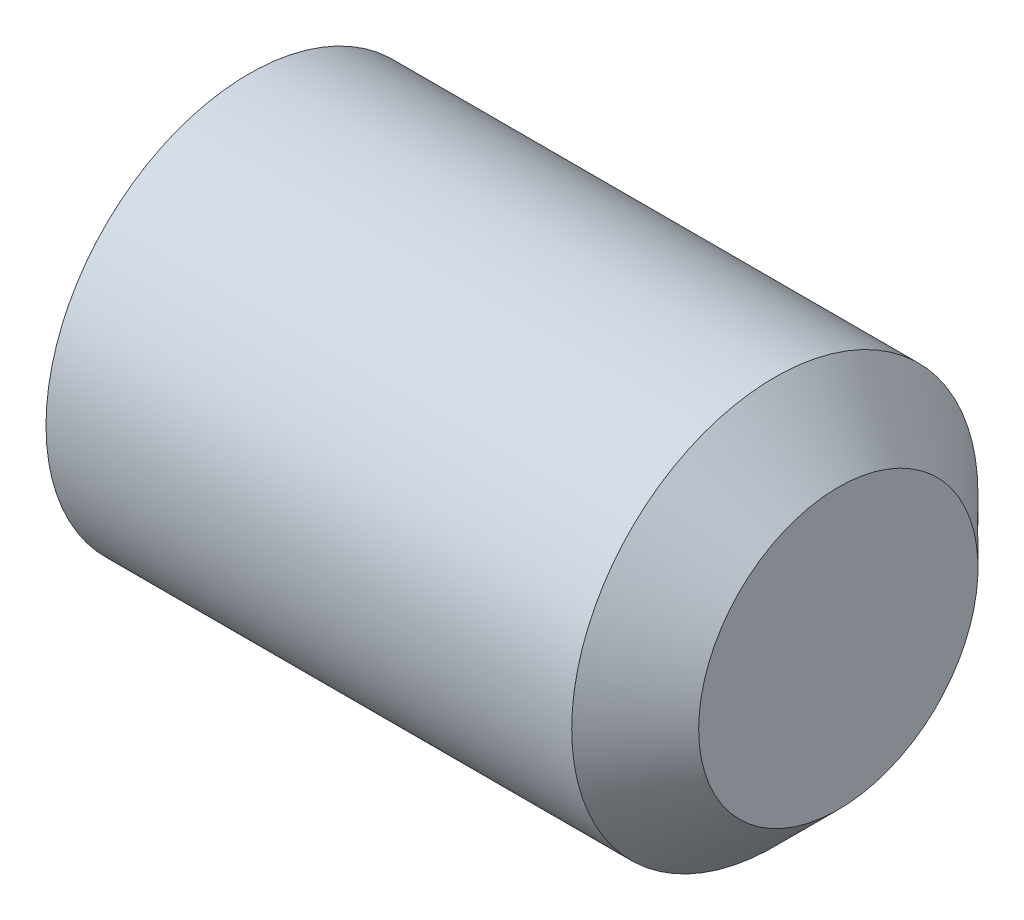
from build123d import *

# Parameters (mm, degrees)
HEX_2_DEPTH = 5


with BuildPart() as part:
    # BodySke → BaseBody (revolve)
    with BuildSketch(Plane.XY, mode=Mode.PRIVATE) as basebody_sk:
        Polygon((0, 0), (0, 3.3095), (0.398660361, 4), (10.75, 4), (12, 2.75), (12, 0), align=None)
    revolve(basebody_sk.sketch.rotate(Axis((-12.7, 0, 0), (1, 0, 0)), 90), axis=Axis((-12.7, 0, 0), (1, 0, 0)))

    # Sketch2 → Hex 2 (cut)
    with BuildSketch(Plane.ZY):
        Polygon((1.154700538, 2), (-1.154700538, 2), (-2.309401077, 0), (-1.154700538, -2), (1.154700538, -2), (2.309401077, 0), align=None)
    extrude(amount=-HEX_2_DEPTH, mode=Mode.SUBTRACT)


solid = part.part
